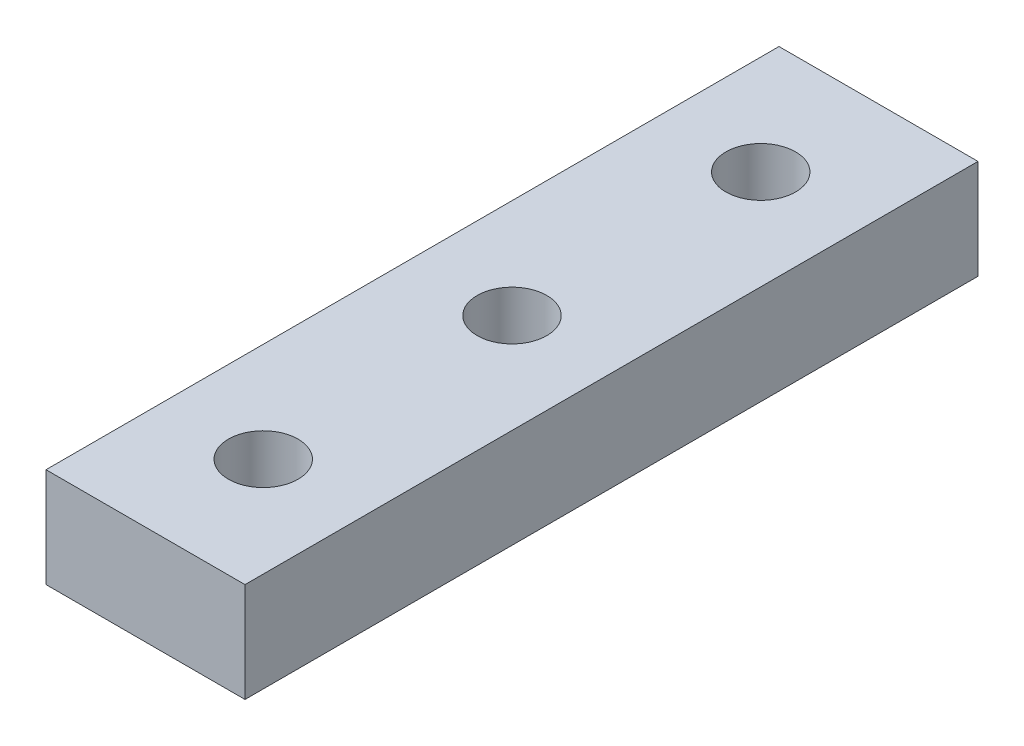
ISO-10303-21;
HEADER;
FILE_DESCRIPTION(('STEP AP214'),'2;1');
FILE_NAME('part.step','',(''),(''),'','','');
FILE_SCHEMA(('AUTOMOTIVE_DESIGN { 1 0 10303 214 1 1 1 1 }'));
ENDSEC;
DATA;
#1=APPLICATION_CONTEXT('core data for automotive mechanical design processes');
#2=APPLICATION_PROTOCOL_DEFINITION('international standard','automotive_design',2000,#1);
#3=PRODUCT_CONTEXT('',#1,'mechanical');
#4=PRODUCT('Part','Part','',(#3));
#5=PRODUCT_RELATED_PRODUCT_CATEGORY('part','',(#4));
#6=PRODUCT_DEFINITION_FORMATION('','',#4);
#7=PRODUCT_DEFINITION_CONTEXT('part definition',#1,'design');
#8=PRODUCT_DEFINITION('design','',#6,#7);
#9=PRODUCT_DEFINITION_SHAPE('','',#8);
#10=(LENGTH_UNIT() NAMED_UNIT(*) SI_UNIT(.MILLI.,.METRE.));
#11=(NAMED_UNIT(*) PLANE_ANGLE_UNIT() SI_UNIT($,.RADIAN.));
#12=(NAMED_UNIT(*) SI_UNIT($,.STERADIAN.) SOLID_ANGLE_UNIT());
#13=UNCERTAINTY_MEASURE_WITH_UNIT(LENGTH_MEASURE(1.E-05),#10,'distance_accuracy_value','');
#14=(GEOMETRIC_REPRESENTATION_CONTEXT(3) GLOBAL_UNCERTAINTY_ASSIGNED_CONTEXT((#13)) GLOBAL_UNIT_ASSIGNED_CONTEXT((#10,
#11,#12)) REPRESENTATION_CONTEXT('',''));
#15=CARTESIAN_POINT('',(0.,0.,0.));
#16=DIRECTION('',(0.,0.,1.));
#17=DIRECTION('',(1.,0.,0.));
#18=AXIS2_PLACEMENT_3D('',#15,#16,#17);
#19=CARTESIAN_POINT('',(0.,6.,0.));
#20=DIRECTION('',(0.,-1.,0.));
#21=DIRECTION('',(0.,0.,-1.));
#22=AXIS2_PLACEMENT_3D('',#19,#20,#21);
#23=PLANE('',#22);
#24=DIRECTION('',(0.,0.,1.));
#25=VECTOR('',#24,1.);
#26=CARTESIAN_POINT('',(0.,6.,0.));
#27=LINE('',#26,#25);
#28=CARTESIAN_POINT('',(0.,6.,-44.2));
#29=VERTEX_POINT('',#28);
#30=CARTESIAN_POINT('',(0.,6.,0.));
#31=VERTEX_POINT('',#30);
#32=EDGE_CURVE('E86',#29,#31,#27,.T.);
#33=ORIENTED_EDGE('',*,*,#32,.T.);
#34=DIRECTION('',(1.,0.,0.));
#35=VECTOR('',#34,1.);
#36=CARTESIAN_POINT('',(0.,6.,0.));
#37=LINE('',#36,#35);
#38=CARTESIAN_POINT('',(12.,6.,0.));
#39=VERTEX_POINT('',#38);
#40=EDGE_CURVE('E81',#31,#39,#37,.T.);
#41=ORIENTED_EDGE('',*,*,#40,.T.);
#42=DIRECTION('',(0.,0.,-1.));
#43=VECTOR('',#42,1.);
#44=CARTESIAN_POINT('',(12.,6.,0.));
#45=LINE('',#44,#43);
#46=CARTESIAN_POINT('',(12.,6.,-44.2));
#47=VERTEX_POINT('',#46);
#48=EDGE_CURVE('E84',#39,#47,#45,.T.);
#49=ORIENTED_EDGE('',*,*,#48,.T.);
#50=DIRECTION('',(-1.,0.,0.));
#51=VECTOR('',#50,1.);
#52=CARTESIAN_POINT('',(0.,6.,-44.2));
#53=LINE('',#52,#51);
#54=EDGE_CURVE('E51',#47,#29,#53,.T.);
#55=ORIENTED_EDGE('',*,*,#54,.T.);
#56=EDGE_LOOP('',(#33,#41,#49,#55));
#57=FACE_BOUND('',#56,.T.);
#58=CARTESIAN_POINT('',(6.,6.,-22.1));
#59=DIRECTION('',(0.,1.,0.));
#60=DIRECTION('',(0.,0.,1.));
#61=AXIS2_PLACEMENT_3D('',#58,#59,#60);
#62=CIRCLE('',#61,2.1);
#63=CARTESIAN_POINT('',(6.,6.,-20.));
#64=VERTEX_POINT('',#63);
#65=EDGE_CURVE('E101',#64,#64,#62,.T.);
#66=ORIENTED_EDGE('',*,*,#65,.F.);
#67=EDGE_LOOP('',(#66));
#68=FACE_BOUND('',#67,.T.);
#69=CARTESIAN_POINT('',(6.,6.,-37.1));
#70=DIRECTION('',(0.,1.,0.));
#71=DIRECTION('',(0.,0.,1.));
#72=AXIS2_PLACEMENT_3D('',#69,#70,#71);
#73=CIRCLE('',#72,2.1);
#74=CARTESIAN_POINT('',(6.,6.,-35.));
#75=VERTEX_POINT('',#74);
#76=EDGE_CURVE('E116',#75,#75,#73,.T.);
#77=ORIENTED_EDGE('',*,*,#76,.F.);
#78=EDGE_LOOP('',(#77));
#79=FACE_BOUND('',#78,.T.);
#80=CARTESIAN_POINT('',(6.,6.,-7.1));
#81=DIRECTION('',(0.,1.,0.));
#82=DIRECTION('',(0.,0.,1.));
#83=AXIS2_PLACEMENT_3D('',#80,#81,#82);
#84=CIRCLE('',#83,2.1);
#85=CARTESIAN_POINT('',(6.,6.,-5.));
#86=VERTEX_POINT('',#85);
#87=EDGE_CURVE('E122',#86,#86,#84,.T.);
#88=ORIENTED_EDGE('',*,*,#87,.F.);
#89=EDGE_LOOP('',(#88));
#90=FACE_BOUND('',#89,.T.);
#91=ADVANCED_FACE('F34',(#57,#68,#79,#90),#23,.F.);
#92=CARTESIAN_POINT('',(0.,0.,0.));
#93=DIRECTION('',(0.,-1.,0.));
#94=DIRECTION('',(0.,0.,-1.));
#95=AXIS2_PLACEMENT_3D('',#92,#93,#94);
#96=PLANE('',#95);
#97=CARTESIAN_POINT('',(6.,0.,-37.1));
#98=DIRECTION('',(0.,1.,0.));
#99=DIRECTION('',(0.,0.,1.));
#100=AXIS2_PLACEMENT_3D('',#97,#98,#99);
#101=CIRCLE('',#100,2.1);
#102=CARTESIAN_POINT('',(6.,0.,-35.));
#103=VERTEX_POINT('',#102);
#104=EDGE_CURVE('E119',#103,#103,#101,.T.);
#105=ORIENTED_EDGE('',*,*,#104,.T.);
#106=EDGE_LOOP('',(#105));
#107=FACE_BOUND('',#106,.T.);
#108=DIRECTION('',(0.,0.,1.));
#109=VECTOR('',#108,1.);
#110=CARTESIAN_POINT('',(0.,0.,0.));
#111=LINE('',#110,#109);
#112=CARTESIAN_POINT('',(0.,0.,-44.2));
#113=VERTEX_POINT('',#112);
#114=CARTESIAN_POINT('',(0.,0.,0.));
#115=VERTEX_POINT('',#114);
#116=EDGE_CURVE('E98',#113,#115,#111,.T.);
#117=ORIENTED_EDGE('',*,*,#116,.F.);
#118=DIRECTION('',(-1.,0.,0.));
#119=VECTOR('',#118,1.);
#120=CARTESIAN_POINT('',(0.,0.,-44.2));
#121=LINE('',#120,#119);
#122=CARTESIAN_POINT('',(12.,0.,-44.2));
#123=VERTEX_POINT('',#122);
#124=EDGE_CURVE('E74',#123,#113,#121,.T.);
#125=ORIENTED_EDGE('',*,*,#124,.F.);
#126=DIRECTION('',(0.,0.,-1.));
#127=VECTOR('',#126,1.);
#128=CARTESIAN_POINT('',(12.,0.,0.));
#129=LINE('',#128,#127);
#130=CARTESIAN_POINT('',(12.,0.,0.));
#131=VERTEX_POINT('',#130);
#132=EDGE_CURVE('E68',#131,#123,#129,.T.);
#133=ORIENTED_EDGE('',*,*,#132,.F.);
#134=DIRECTION('',(1.,0.,0.));
#135=VECTOR('',#134,1.);
#136=CARTESIAN_POINT('',(0.,0.,0.));
#137=LINE('',#136,#135);
#138=EDGE_CURVE('E90',#115,#131,#137,.T.);
#139=ORIENTED_EDGE('',*,*,#138,.F.);
#140=EDGE_LOOP('',(#117,#125,#133,#139));
#141=FACE_BOUND('',#140,.T.);
#142=CARTESIAN_POINT('',(6.,0.,-22.1));
#143=DIRECTION('',(0.,1.,0.));
#144=DIRECTION('',(0.,0.,1.));
#145=AXIS2_PLACEMENT_3D('',#142,#143,#144);
#146=CIRCLE('',#145,2.1);
#147=CARTESIAN_POINT('',(6.,0.,-20.));
#148=VERTEX_POINT('',#147);
#149=EDGE_CURVE('E113',#148,#148,#146,.T.);
#150=ORIENTED_EDGE('',*,*,#149,.T.);
#151=EDGE_LOOP('',(#150));
#152=FACE_BOUND('',#151,.T.);
#153=CARTESIAN_POINT('',(6.,0.,-7.1));
#154=DIRECTION('',(0.,1.,0.));
#155=DIRECTION('',(0.,0.,1.));
#156=AXIS2_PLACEMENT_3D('',#153,#154,#155);
#157=CIRCLE('',#156,2.1);
#158=CARTESIAN_POINT('',(6.,0.,-5.));
#159=VERTEX_POINT('',#158);
#160=EDGE_CURVE('E125',#159,#159,#157,.T.);
#161=ORIENTED_EDGE('',*,*,#160,.T.);
#162=EDGE_LOOP('',(#161));
#163=FACE_BOUND('',#162,.T.);
#164=ADVANCED_FACE('F109',(#107,#141,#152,#163),#96,.T.);
#165=CARTESIAN_POINT('',(0.,6.,0.));
#166=DIRECTION('',(1.,0.,0.));
#167=DIRECTION('',(0.,0.,-1.));
#168=AXIS2_PLACEMENT_3D('',#165,#166,#167);
#169=PLANE('',#168);
#170=ORIENTED_EDGE('',*,*,#116,.T.);
#171=DIRECTION('',(0.,-1.,0.));
#172=VECTOR('',#171,1.);
#173=CARTESIAN_POINT('',(0.,6.,0.));
#174=LINE('',#173,#172);
#175=EDGE_CURVE('E11',#31,#115,#174,.T.);
#176=ORIENTED_EDGE('',*,*,#175,.F.);
#177=ORIENTED_EDGE('',*,*,#32,.F.);
#178=DIRECTION('',(0.,-1.,0.));
#179=VECTOR('',#178,1.);
#180=CARTESIAN_POINT('',(0.,6.,-44.2));
#181=LINE('',#180,#179);
#182=EDGE_CURVE('E94',#29,#113,#181,.T.);
#183=ORIENTED_EDGE('',*,*,#182,.T.);
#184=EDGE_LOOP('',(#170,#176,#177,#183));
#185=FACE_BOUND('',#184,.T.);
#186=ADVANCED_FACE('F36',(#185),#169,.F.);
#187=CARTESIAN_POINT('',(0.,6.,0.));
#188=DIRECTION('',(0.,0.,-1.));
#189=DIRECTION('',(-1.,0.,0.));
#190=AXIS2_PLACEMENT_3D('',#187,#188,#189);
#191=PLANE('',#190);
#192=ORIENTED_EDGE('',*,*,#138,.T.);
#193=DIRECTION('',(0.,-1.,0.));
#194=VECTOR('',#193,1.);
#195=CARTESIAN_POINT('',(12.,6.,0.));
#196=LINE('',#195,#194);
#197=EDGE_CURVE('E43',#39,#131,#196,.T.);
#198=ORIENTED_EDGE('',*,*,#197,.F.);
#199=ORIENTED_EDGE('',*,*,#40,.F.);
#200=ORIENTED_EDGE('',*,*,#175,.T.);
#201=EDGE_LOOP('',(#192,#198,#199,#200));
#202=FACE_BOUND('',#201,.T.);
#203=ADVANCED_FACE('F89',(#202),#191,.F.);
#204=CARTESIAN_POINT('',(12.,6.,0.));
#205=DIRECTION('',(-1.,0.,0.));
#206=DIRECTION('',(0.,0.,1.));
#207=AXIS2_PLACEMENT_3D('',#204,#205,#206);
#208=PLANE('',#207);
#209=ORIENTED_EDGE('',*,*,#132,.T.);
#210=DIRECTION('',(0.,-1.,0.));
#211=VECTOR('',#210,1.);
#212=CARTESIAN_POINT('',(12.,6.,-44.2));
#213=LINE('',#212,#211);
#214=EDGE_CURVE('E91',#47,#123,#213,.T.);
#215=ORIENTED_EDGE('',*,*,#214,.F.);
#216=ORIENTED_EDGE('',*,*,#48,.F.);
#217=ORIENTED_EDGE('',*,*,#197,.T.);
#218=EDGE_LOOP('',(#209,#215,#216,#217));
#219=FACE_BOUND('',#218,.T.);
#220=ADVANCED_FACE('F92',(#219),#208,.F.);
#221=CARTESIAN_POINT('',(0.,6.,-44.2));
#222=DIRECTION('',(0.,0.,1.));
#223=DIRECTION('',(1.,0.,0.));
#224=AXIS2_PLACEMENT_3D('',#221,#222,#223);
#225=PLANE('',#224);
#226=ORIENTED_EDGE('',*,*,#124,.T.);
#227=ORIENTED_EDGE('',*,*,#182,.F.);
#228=ORIENTED_EDGE('',*,*,#54,.F.);
#229=ORIENTED_EDGE('',*,*,#214,.T.);
#230=EDGE_LOOP('',(#226,#227,#228,#229));
#231=FACE_BOUND('',#230,.T.);
#232=ADVANCED_FACE('F106',(#231),#225,.F.);
#233=CARTESIAN_POINT('',(6.,6.,-22.1));
#234=DIRECTION('',(0.,-1.,0.));
#235=DIRECTION('',(0.,0.,-1.));
#236=AXIS2_PLACEMENT_3D('',#233,#234,#235);
#237=CYLINDRICAL_SURFACE('',#236,2.1);
#238=ORIENTED_EDGE('',*,*,#65,.T.);
#239=EDGE_LOOP('',(#238));
#240=FACE_BOUND('',#239,.T.);
#241=ORIENTED_EDGE('',*,*,#149,.F.);
#242=EDGE_LOOP('',(#241));
#243=FACE_BOUND('',#242,.T.);
#244=ADVANCED_FACE('F142',(#240,#243),#237,.F.);
#245=CARTESIAN_POINT('',(6.,6.,-37.1));
#246=DIRECTION('',(0.,-1.,0.));
#247=DIRECTION('',(0.,0.,-1.));
#248=AXIS2_PLACEMENT_3D('',#245,#246,#247);
#249=CYLINDRICAL_SURFACE('',#248,2.1);
#250=ORIENTED_EDGE('',*,*,#76,.T.);
#251=EDGE_LOOP('',(#250));
#252=FACE_BOUND('',#251,.T.);
#253=ORIENTED_EDGE('',*,*,#104,.F.);
#254=EDGE_LOOP('',(#253));
#255=FACE_BOUND('',#254,.T.);
#256=ADVANCED_FACE('F188',(#252,#255),#249,.F.);
#257=CARTESIAN_POINT('',(6.,6.,-7.1));
#258=DIRECTION('',(0.,-1.,0.));
#259=DIRECTION('',(0.,0.,-1.));
#260=AXIS2_PLACEMENT_3D('',#257,#258,#259);
#261=CYLINDRICAL_SURFACE('',#260,2.1);
#262=ORIENTED_EDGE('',*,*,#87,.T.);
#263=EDGE_LOOP('',(#262));
#264=FACE_BOUND('',#263,.T.);
#265=ORIENTED_EDGE('',*,*,#160,.F.);
#266=EDGE_LOOP('',(#265));
#267=FACE_BOUND('',#266,.T.);
#268=ADVANCED_FACE('F131',(#264,#267),#261,.F.);
#269=CLOSED_SHELL('',(#91,#164,#186,#203,#220,#232,#244,#256,#268));
#270=MANIFOLD_SOLID_BREP('B2',#269);
#271=ADVANCED_BREP_SHAPE_REPRESENTATION('',(#18,#270),#14);
#272=SHAPE_DEFINITION_REPRESENTATION(#9,#271);
ENDSEC;
END-ISO-10303-21;
